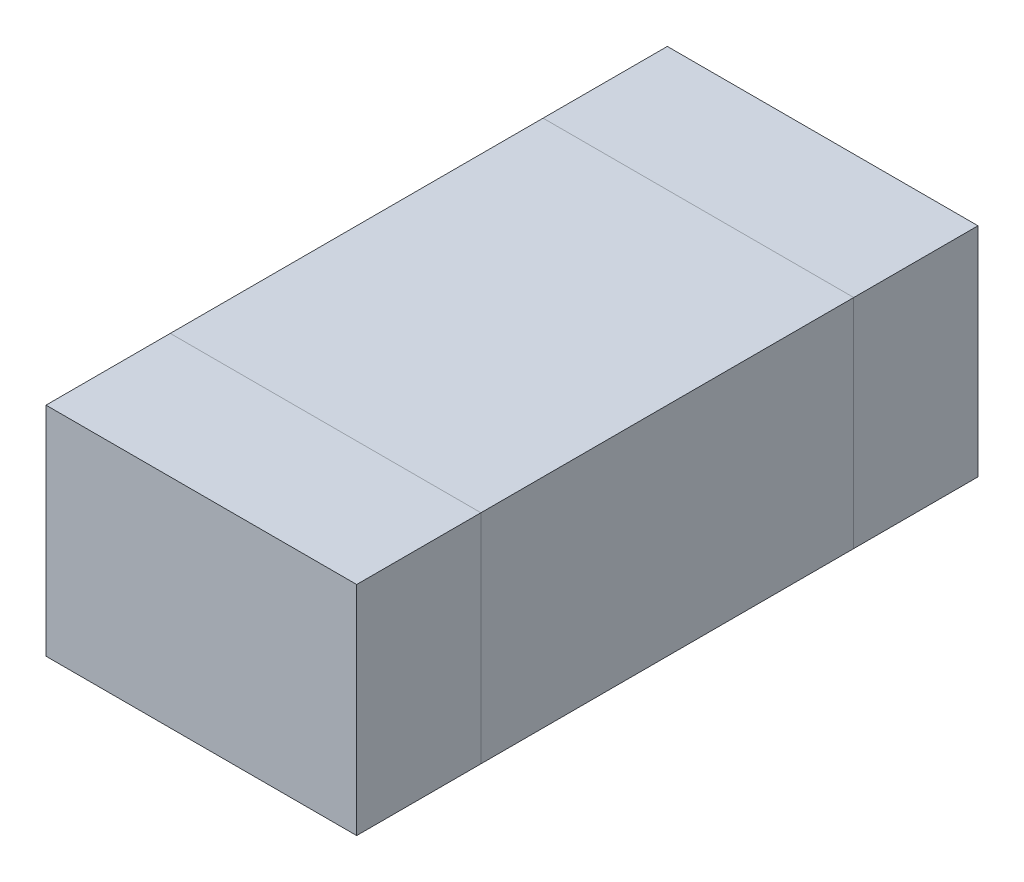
from build123d import *

# Parameters (mm, degrees)
MAINBODYS_W     = 0.5
MAINBODYS_H     = 0.6
MAINBODY_DEPTH  = 0.35
LEFTBODYS_W     = 0.5
LEFTBODYS_H     = 0.2
LEFTBODY_DEPTH  = 0.35
RIGHTBODYS_W    = 0.5
RIGHTBODYS_H    = 0.2
RIGHTBODY_DEPTH = 0.35


with BuildPart() as part:
    # MainBodyS → MainBody (new body)
    with BuildSketch(Plane(origin=(0, 0, 0), x_dir=(1, 0, 0), z_dir=(0, 1, 0))):
        Rectangle(MAINBODYS_W, MAINBODYS_H)
    extrude(amount=MAINBODY_DEPTH)


with BuildPart() as body_2:
    # LeftBodyS → LeftBody (new body)
    with BuildSketch(Plane(origin=(0, 0, 0), x_dir=(-1, 0, 0), z_dir=(0, -1, 0))):
        with Locations((0, -0.4)):
            Rectangle(LEFTBODYS_W, LEFTBODYS_H)
    extrude(amount=-LEFTBODY_DEPTH)


with BuildPart() as body_3:
    # RightBodyS → RightBody (new body)
    with BuildSketch(Plane.XZ):
        with Locations((0, -0.4)):
            Rectangle(RIGHTBODYS_W, RIGHTBODYS_H)
    extrude(amount=-RIGHTBODY_DEPTH)


solid = Compound([part.part, body_2.part, body_3.part])
